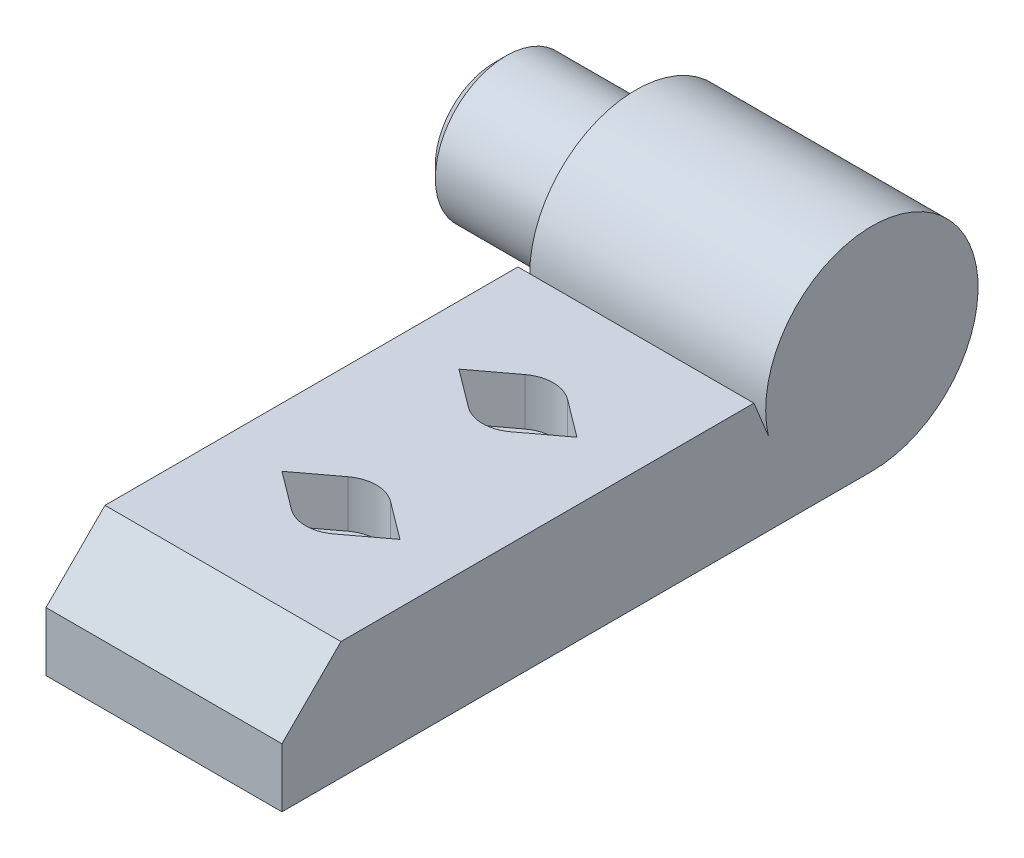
from build123d import *

# Parameters (mm, degrees)
BOSS_EXTRUDE1_DEPTH = 20
CUT_EXTRUDE1_REACH  = 65.095
SKETCH2_R           = 1.75
SKETCH3_R           = 3
CUT_EXTRUDE2_DEPTH  = 4
SKETCH4_R           = 6
BOSS_EXTRUDE2_DEPTH = 12
CHAMFER1_SIZE       = 1
CUT_EXTRUDE3_DEPTH  = 4


with BuildPart() as part:
    # Sketch1 → Boss-Extrude1 (new body)
    with BuildSketch(Plane(origin=(0, 0, 0), x_dir=(0, 0, -1), z_dir=(1, 0, 0))):
        with BuildLine():
            Line((0, 0), (50, 0))
            ThreePointArc((50, 0), (55.61248608, 16.03562364), (41.225035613, 7))
            Line((41.225035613, 7), (40, 10))
            Line((40, 10), (5, 10))
            Line((5, 10), (0, 5))
            Line((0, 5), (0, 0))
        make_face()
    extrude(amount=-BOSS_EXTRUDE1_DEPTH)

    # Sketch2 → Cut-Extrude1 (cut, up to next)
    with BuildSketch(Plane(origin=(0, 10, 0), x_dir=(1, 0, 0), z_dir=(0, 1, 0)), mode=Mode.PRIVATE) as cut_extrude1_sk1:
        with Locations(Location((-10, 30, 0), (0, 0, 270))):
            Circle(SKETCH2_R)
    cut_extrude1_tool1 = extrude(cut_extrude1_sk1.sketch, amount=-CUT_EXTRUDE1_REACH, mode=Mode.PRIVATE) & part.part
    # Sketch2 → Cut-Extrude1 (cut, up to next)
    with BuildSketch(Plane(origin=(0, 10, 0), x_dir=(1, 0, 0), z_dir=(0, 1, 0)), mode=Mode.PRIVATE) as cut_extrude1_sk2:
        with Locations(Location((-10, 15, 0), (0, 0, 270))):
            Circle(SKETCH2_R)
    cut_extrude1_tool2 = extrude(cut_extrude1_sk2.sketch, amount=-CUT_EXTRUDE1_REACH, mode=Mode.PRIVATE) & part.part
    add(cut_extrude1_tool1.solids().sort_by_distance((-10, 10, -30))[0], mode=Mode.SUBTRACT)
    add(cut_extrude1_tool2.solids().sort_by_distance((-10, 10, -15))[0], mode=Mode.SUBTRACT)

    # Sketch3 → Cut-Extrude2 (cut)
    with BuildSketch(Plane(origin=(0, 10, 0), x_dir=(1, 0, 0), z_dir=(0, 1, 0))):
        with Locations(Location((-10, 30, 0), (0, 0, 270))):
            Circle(SKETCH3_R)
        with Locations(Location((-10, 15, 0), (0, 0, 270))):
            Circle(SKETCH3_R)
    extrude(amount=-CUT_EXTRUDE2_DEPTH, mode=Mode.SUBTRACT)

    # Sketch4 → Boss-Extrude2 (add)
    with BuildSketch(Plane.ZY.offset(20)):
        with Locations(Location((-50, 9, 0), (0, 0, 180))):
            Circle(SKETCH4_R)
    extrude(amount=BOSS_EXTRUDE2_DEPTH)

    # Chamfer1
    chamfer1_edges = [part.edges().sort_by_distance(p)[0] for p in [
        (-32, 9, -44),
    ]]
    chamfer(chamfer1_edges, length=CHAMFER1_SIZE)

    # Sketch6 → Cut-Extrude3 (cut)
    with BuildSketch(Plane(origin=(0, 10, 0), x_dir=(1, 0, 0), z_dir=(0, 1, 0))):
        with BuildLine():
            Line((-15, 30), (-11.8, 27.6))
            ThreePointArc((-11.8, 27.6), (-10, 27), (-8.2, 27.6))
            Line((-8.2, 27.6), (-5, 30))
            Line((-5, 30), (-8.2, 32.4))
            ThreePointArc((-8.2, 32.4), (-10, 33), (-11.8, 32.4))
            Line((-11.8, 32.4), (-15, 30))
        make_face()
        with BuildLine():
            Line((-15, 15), (-11.8, 12.6))
            ThreePointArc((-11.8, 12.6), (-10, 12), (-8.2, 12.6))
            Line((-8.2, 12.6), (-5, 15))
            Line((-5, 15), (-8.2, 17.4))
            ThreePointArc((-8.2, 17.4), (-10, 18), (-11.8, 17.4))
            Line((-11.8, 17.4), (-15, 15))
        make_face()
    extrude(amount=-CUT_EXTRUDE3_DEPTH, mode=Mode.SUBTRACT)


solid = part.part
